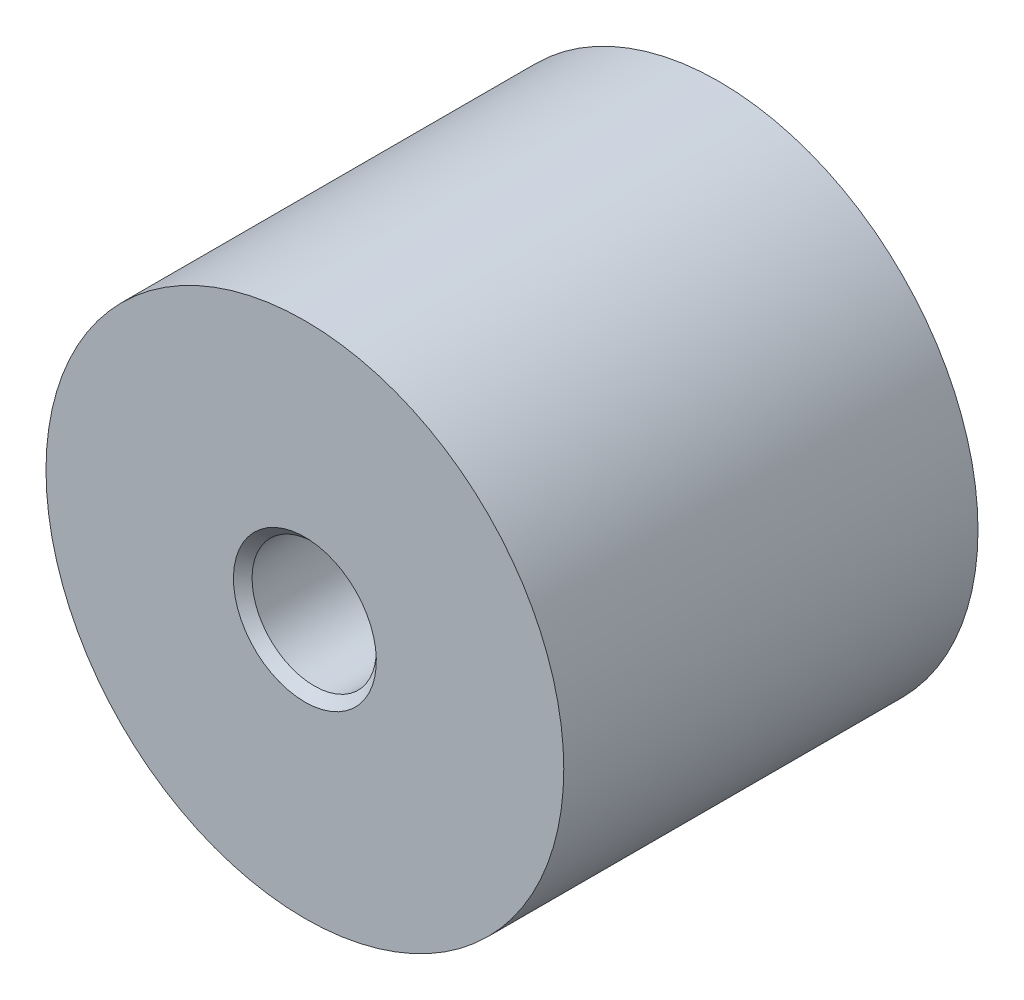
ISO-10303-21;
HEADER;
FILE_DESCRIPTION(('STEP AP214'),'2;1');
FILE_NAME('part.step','',(''),(''),'','','');
FILE_SCHEMA(('AUTOMOTIVE_DESIGN { 1 0 10303 214 1 1 1 1 }'));
ENDSEC;
DATA;
#1=APPLICATION_CONTEXT('core data for automotive mechanical design processes');
#2=APPLICATION_PROTOCOL_DEFINITION('international standard','automotive_design',2000,#1);
#3=PRODUCT_CONTEXT('',#1,'mechanical');
#4=PRODUCT('Part','Part','',(#3));
#5=PRODUCT_RELATED_PRODUCT_CATEGORY('part','',(#4));
#6=PRODUCT_DEFINITION_FORMATION('','',#4);
#7=PRODUCT_DEFINITION_CONTEXT('part definition',#1,'design');
#8=PRODUCT_DEFINITION('design','',#6,#7);
#9=PRODUCT_DEFINITION_SHAPE('','',#8);
#10=(LENGTH_UNIT() NAMED_UNIT(*) SI_UNIT(.MILLI.,.METRE.));
#11=(NAMED_UNIT(*) PLANE_ANGLE_UNIT() SI_UNIT($,.RADIAN.));
#12=(NAMED_UNIT(*) SI_UNIT($,.STERADIAN.) SOLID_ANGLE_UNIT());
#13=UNCERTAINTY_MEASURE_WITH_UNIT(LENGTH_MEASURE(1.E-05),#10,'distance_accuracy_value','');
#14=(GEOMETRIC_REPRESENTATION_CONTEXT(3) GLOBAL_UNCERTAINTY_ASSIGNED_CONTEXT((#13)) GLOBAL_UNIT_ASSIGNED_CONTEXT((#10,
#11,#12)) REPRESENTATION_CONTEXT('',''));
#15=CARTESIAN_POINT('',(0.,0.,0.));
#16=DIRECTION('',(0.,0.,1.));
#17=DIRECTION('',(1.,0.,0.));
#18=AXIS2_PLACEMENT_3D('',#15,#16,#17);
#19=CARTESIAN_POINT('',(11.666666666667,0.,20.));
#20=DIRECTION('',(0.,0.,1.));
#21=DIRECTION('',(0.,-1.,0.));
#22=AXIS2_PLACEMENT_3D('',#19,#20,#21);
#23=PLANE('',#22);
#24=CARTESIAN_POINT('',(0.,0.,20.));
#25=DIRECTION('',(0.,0.,1.));
#26=DIRECTION('',(0.,-1.,0.));
#27=AXIS2_PLACEMENT_3D('',#24,#25,#26);
#28=CIRCLE('',#27,3.45);
#29=CARTESIAN_POINT('',(0.,-3.45,20.));
#30=VERTEX_POINT('',#29);
#31=EDGE_CURVE('E23',#30,#30,#28,.F.);
#32=ORIENTED_EDGE('',*,*,#31,.T.);
#33=EDGE_LOOP('',(#32));
#34=FACE_BOUND('',#33,.T.);
#35=CARTESIAN_POINT('',(0.,0.,20.));
#36=DIRECTION('',(0.,0.,1.));
#37=DIRECTION('',(0.,-1.,0.));
#38=AXIS2_PLACEMENT_3D('',#35,#36,#37);
#39=CIRCLE('',#38,12.5);
#40=CARTESIAN_POINT('',(0.,-12.5,20.));
#41=VERTEX_POINT('',#40);
#42=EDGE_CURVE('E32',#41,#41,#39,.T.);
#43=ORIENTED_EDGE('',*,*,#42,.T.);
#44=EDGE_LOOP('',(#43));
#45=FACE_BOUND('',#44,.T.);
#46=ADVANCED_FACE('F12',(#34,#45),#23,.T.);
#47=CARTESIAN_POINT('',(0.,0.,0.66666666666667));
#48=DIRECTION('',(0.,0.,1.));
#49=DIRECTION('',(0.,-1.,0.));
#50=AXIS2_PLACEMENT_3D('',#47,#48,#49);
#51=CYLINDRICAL_SURFACE('',#50,12.5);
#52=CARTESIAN_POINT('',(0.,0.,0.));
#53=DIRECTION('',(0.,0.,1.));
#54=DIRECTION('',(0.,-1.,0.));
#55=AXIS2_PLACEMENT_3D('',#52,#53,#54);
#56=CIRCLE('',#55,12.5);
#57=CARTESIAN_POINT('',(0.,-12.5,0.));
#58=VERTEX_POINT('',#57);
#59=EDGE_CURVE('E35',#58,#58,#56,.T.);
#60=ORIENTED_EDGE('',*,*,#59,.T.);
#61=EDGE_LOOP('',(#60));
#62=FACE_BOUND('',#61,.T.);
#63=ORIENTED_EDGE('',*,*,#42,.F.);
#64=EDGE_LOOP('',(#63));
#65=FACE_BOUND('',#64,.T.);
#66=ADVANCED_FACE('F64',(#62,#65),#51,.T.);
#67=CARTESIAN_POINT('',(12.5,0.,0.));
#68=DIRECTION('',(0.,0.,-1.));
#69=DIRECTION('',(0.,1.,0.));
#70=AXIS2_PLACEMENT_3D('',#67,#68,#69);
#71=PLANE('',#70);
#72=CARTESIAN_POINT('',(0.,0.,0.));
#73=DIRECTION('',(0.,0.,-1.));
#74=DIRECTION('',(0.,1.,0.));
#75=AXIS2_PLACEMENT_3D('',#72,#73,#74);
#76=CIRCLE('',#75,3.45);
#77=CARTESIAN_POINT('',(0.,3.45,0.));
#78=VERTEX_POINT('',#77);
#79=EDGE_CURVE('E8',#78,#78,#76,.F.);
#80=ORIENTED_EDGE('',*,*,#79,.T.);
#81=EDGE_LOOP('',(#80));
#82=FACE_BOUND('',#81,.T.);
#83=ORIENTED_EDGE('',*,*,#59,.F.);
#84=EDGE_LOOP('',(#83));
#85=FACE_BOUND('',#84,.T.);
#86=ADVANCED_FACE('F70',(#82,#85),#71,.T.);
#87=CARTESIAN_POINT('',(0.,0.,16.));
#88=DIRECTION('',(0.,0.,1.));
#89=DIRECTION('',(0.,-1.,0.));
#90=AXIS2_PLACEMENT_3D('',#87,#88,#89);
#91=CYLINDRICAL_SURFACE('',#90,3.);
#92=CARTESIAN_POINT('',(0.,0.,19.55));
#93=DIRECTION('',(0.,0.,1.));
#94=DIRECTION('',(0.,-1.,0.));
#95=AXIS2_PLACEMENT_3D('',#92,#93,#94);
#96=CIRCLE('',#95,3.);
#97=CARTESIAN_POINT('',(0.,-3.,19.55));
#98=VERTEX_POINT('',#97);
#99=EDGE_CURVE('E27',#98,#98,#96,.T.);
#100=ORIENTED_EDGE('',*,*,#99,.T.);
#101=EDGE_LOOP('',(#100));
#102=FACE_BOUND('',#101,.T.);
#103=CARTESIAN_POINT('',(0.,0.,14.));
#104=DIRECTION('',(0.,0.,1.));
#105=DIRECTION('',(0.,-1.,0.));
#106=AXIS2_PLACEMENT_3D('',#103,#104,#105);
#107=CIRCLE('',#106,3.);
#108=CARTESIAN_POINT('',(0.,-3.,14.));
#109=VERTEX_POINT('',#108);
#110=EDGE_CURVE('E38',#109,#109,#107,.T.);
#111=ORIENTED_EDGE('',*,*,#110,.F.);
#112=EDGE_LOOP('',(#111));
#113=FACE_BOUND('',#112,.T.);
#114=ADVANCED_FACE('F58',(#102,#113),#91,.F.);
#115=CARTESIAN_POINT('',(0.,0.,14.));
#116=DIRECTION('',(0.,0.,1.));
#117=DIRECTION('',(0.,-1.,0.));
#118=AXIS2_PLACEMENT_3D('',#115,#116,#117);
#119=PLANE('',#118);
#120=ORIENTED_EDGE('',*,*,#110,.T.);
#121=EDGE_LOOP('',(#120));
#122=FACE_BOUND('',#121,.T.);
#123=ADVANCED_FACE('F49',(#122),#119,.T.);
#124=CARTESIAN_POINT('',(0.,0.,0.));
#125=DIRECTION('',(0.,0.,1.));
#126=DIRECTION('',(0.,-1.,0.));
#127=AXIS2_PLACEMENT_3D('',#124,#125,#126);
#128=CYLINDRICAL_SURFACE('',#127,3.);
#129=CARTESIAN_POINT('',(0.,0.,0.45));
#130=DIRECTION('',(0.,0.,-1.));
#131=DIRECTION('',(0.,1.,0.));
#132=AXIS2_PLACEMENT_3D('',#129,#130,#131);
#133=CIRCLE('',#132,3.);
#134=CARTESIAN_POINT('',(0.,3.,0.45));
#135=VERTEX_POINT('',#134);
#136=EDGE_CURVE('E19',#135,#135,#133,.T.);
#137=ORIENTED_EDGE('',*,*,#136,.T.);
#138=EDGE_LOOP('',(#137));
#139=FACE_BOUND('',#138,.T.);
#140=CARTESIAN_POINT('',(0.,0.,6.));
#141=DIRECTION('',(0.,0.,-1.));
#142=DIRECTION('',(0.,1.,0.));
#143=AXIS2_PLACEMENT_3D('',#140,#141,#142);
#144=CIRCLE('',#143,3.);
#145=CARTESIAN_POINT('',(0.,3.,6.));
#146=VERTEX_POINT('',#145);
#147=EDGE_CURVE('E41',#146,#146,#144,.T.);
#148=ORIENTED_EDGE('',*,*,#147,.F.);
#149=EDGE_LOOP('',(#148));
#150=FACE_BOUND('',#149,.T.);
#151=ADVANCED_FACE('F47',(#139,#150),#128,.F.);
#152=CARTESIAN_POINT('',(0.,0.,6.));
#153=DIRECTION('',(0.,0.,-1.));
#154=DIRECTION('',(0.,1.,0.));
#155=AXIS2_PLACEMENT_3D('',#152,#153,#154);
#156=PLANE('',#155);
#157=ORIENTED_EDGE('',*,*,#147,.T.);
#158=EDGE_LOOP('',(#157));
#159=FACE_BOUND('',#158,.T.);
#160=ADVANCED_FACE('F45',(#159),#156,.T.);
#161=CARTESIAN_POINT('',(0.,0.,19.55));
#162=DIRECTION('',(0.,0.,1.));
#163=DIRECTION('',(0.,-1.,0.));
#164=AXIS2_PLACEMENT_3D('',#161,#162,#163);
#165=CONICAL_SURFACE('',#164,3.,0.785398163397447);
#166=ORIENTED_EDGE('',*,*,#31,.F.);
#167=EDGE_LOOP('',(#166));
#168=FACE_BOUND('',#167,.T.);
#169=ORIENTED_EDGE('',*,*,#99,.F.);
#170=EDGE_LOOP('',(#169));
#171=FACE_BOUND('',#170,.T.);
#172=ADVANCED_FACE('F56',(#168,#171),#165,.F.);
#173=CARTESIAN_POINT('',(0.,0.,0.45));
#174=DIRECTION('',(0.,0.,-1.));
#175=DIRECTION('',(0.,1.,0.));
#176=AXIS2_PLACEMENT_3D('',#173,#174,#175);
#177=CONICAL_SURFACE('',#176,3.,0.785398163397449);
#178=ORIENTED_EDGE('',*,*,#79,.F.);
#179=EDGE_LOOP('',(#178));
#180=FACE_BOUND('',#179,.T.);
#181=ORIENTED_EDGE('',*,*,#136,.F.);
#182=EDGE_LOOP('',(#181));
#183=FACE_BOUND('',#182,.T.);
#184=ADVANCED_FACE('F14',(#180,#183),#177,.F.);
#185=CLOSED_SHELL('',(#46,#66,#86,#114,#123,#151,#160,#172,#184));
#186=MANIFOLD_SOLID_BREP('B1',#185);
#187=ADVANCED_BREP_SHAPE_REPRESENTATION('',(#18,#186),#14);
#188=SHAPE_DEFINITION_REPRESENTATION(#9,#187);
ENDSEC;
END-ISO-10303-21;
